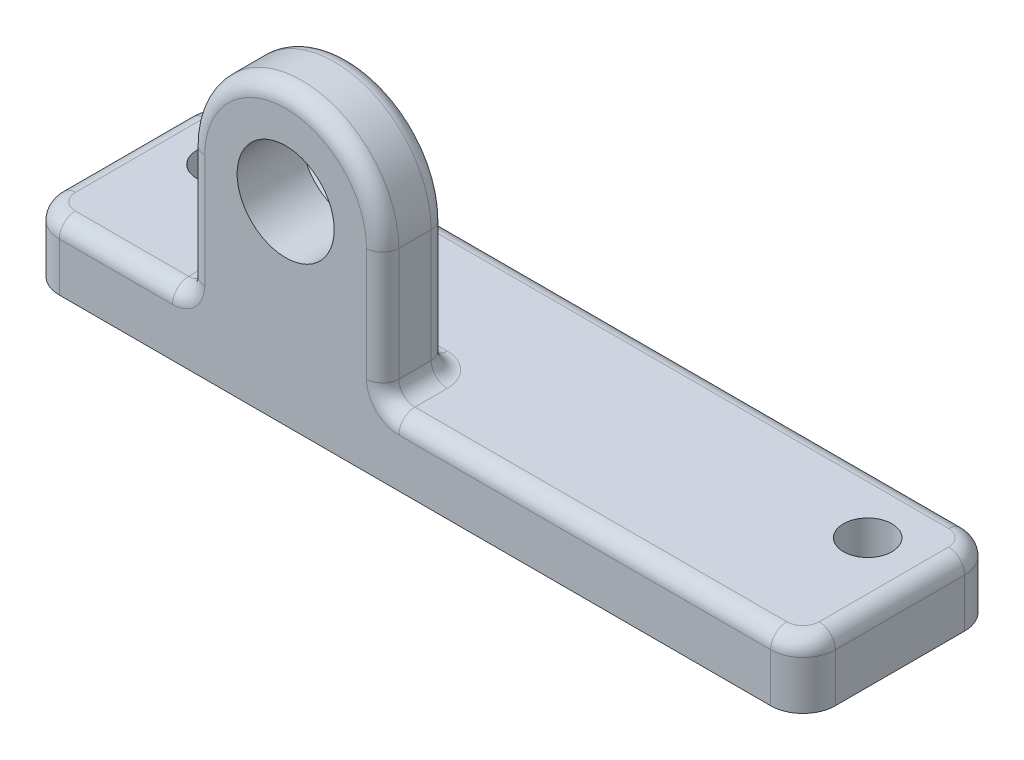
from build123d import *

# Parameters (mm, degrees)
SKETCH1_W                    = 152.4
SKETCH1_H                    = 38.1
BASE_PLATE_DEPTH             = 12.7
VERT_BOSS_DEPTH              = 12.7
F_3_4_0_75_DIAMETER_HOLE1_D  = 19.05
F_3_8_0_375_DIAMETER_HOLE1_D = 9.525
FILLET1_R                    = 6.35
FILLET2_R                    = 3.175


with BuildPart() as part:
    # Sketch1 → Base Plate (new body)
    with BuildSketch(Plane(origin=(0, 0, 0), x_dir=(1, 0, 0), z_dir=(0, 1, 0))):
        with Locations((76.2, 19.05)):
            Rectangle(SKETCH1_W, SKETCH1_H)
    extrude(amount=BASE_PLATE_DEPTH)

    # Sketch2 → Vert_boss (add)
    with BuildSketch(Plane.XY):
        with BuildLine():
            Line((31.75, 0), (31.75, 38.1))
            ThreePointArc((31.75, 38.1), (50.8, 57.15), (69.85, 38.1))
            Line((69.85, 38.1), (69.85, 0))
            Line((69.85, 0), (31.75, 0))
        make_face()
    extrude(amount=-VERT_BOSS_DEPTH)

    # 3_4 _0.75_ Diameter Hole1 (through all)
    with Locations(Plane.XY):
        with Locations((50.8, 38.1)):
            Hole(F_3_4_0_75_DIAMETER_HOLE1_D / 2)

    # 3_8 _0.375_ Diameter Hole1 (through all)
    with Locations(Plane(origin=(0, 12.7, 0), x_dir=(-1, 0, 0), z_dir=(0, 1, 0))):
        with Locations((-139.7, -25.4), (-12.7, -25.4)):
            Hole(F_3_8_0_375_DIAMETER_HOLE1_D / 2)

    # Fillet1
    fillet1_edges = [part.edges().sort_by_distance(p)[0] for p in [
        (0, 6.35, -38.1),
        (152.4, 6.35, -38.1),
        (152.4, 6.35, 0),
        (0, 6.35, 0),
    ]]
    fillet(fillet1_edges, radius=FILLET1_R)

    # Fillet2
    fillet2_edges = [part.edges().sort_by_distance(p)[0] for p in [
        (107.95, 12.7, 0),
        (31.75, 25.4, -12.7),
        (69.85, 25.4, -12.7),
        (31.75, 25.4, 0),
        (69.85, 25.4, 0),
        (50.8, 57.15, 0),
        (31.75, 12.7, -6.35),
        (50.8, 57.15, -12.7),
        (69.85, 12.7, -6.35),
        (50.8, 12.7, -12.7),
        (19.05, 12.7, 0),
        (0, 12.7, -19.05),
        (152.4, 12.7, -19.05),
        (76.2, 12.7, -38.1),
        (150.540128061, 12.7, -36.240128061),
        (150.540128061, 12.7, -1.859871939),
        (1.859871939, 12.7, -36.240128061),
        (1.859871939, 12.7, -1.859871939),
    ]]
    fillet(fillet2_edges, radius=FILLET2_R)


solid = part.part
